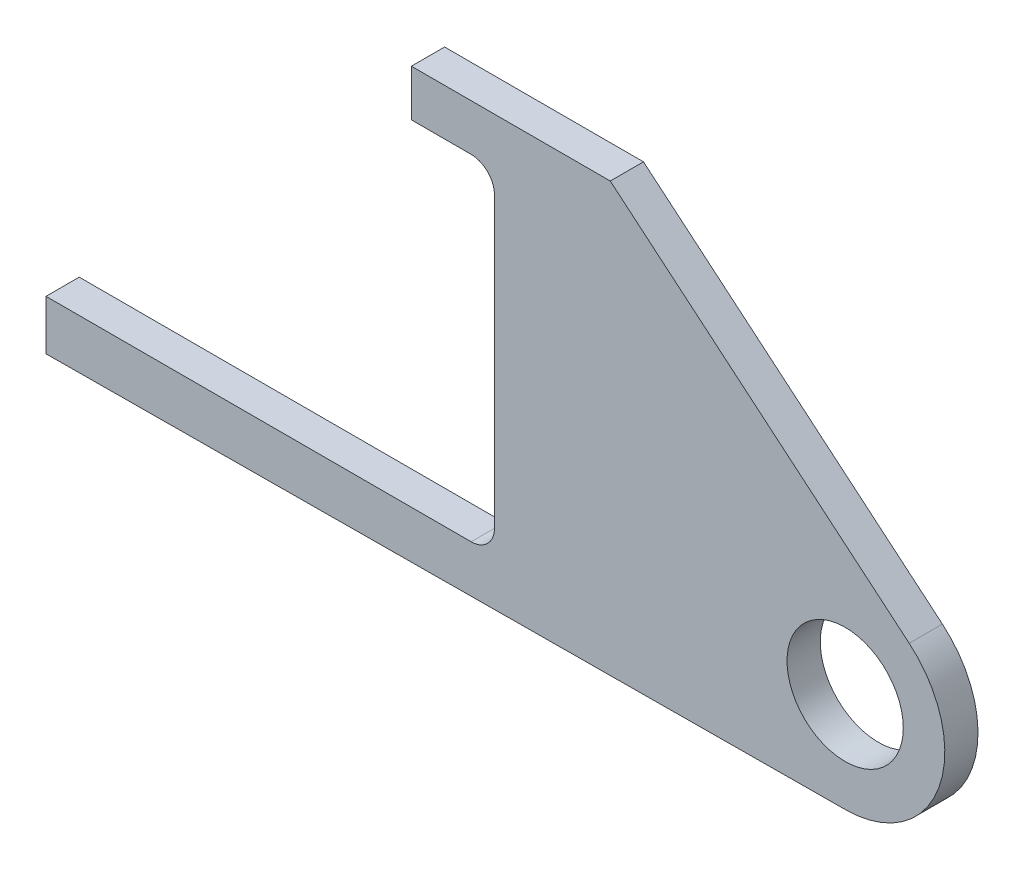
ISO-10303-21;
HEADER;
FILE_DESCRIPTION(('STEP AP214'),'2;1');
FILE_NAME('part.step','',(''),(''),'','','');
FILE_SCHEMA(('AUTOMOTIVE_DESIGN { 1 0 10303 214 1 1 1 1 }'));
ENDSEC;
DATA;
#1=APPLICATION_CONTEXT('core data for automotive mechanical design processes');
#2=APPLICATION_PROTOCOL_DEFINITION('international standard','automotive_design',2000,#1);
#3=PRODUCT_CONTEXT('',#1,'mechanical');
#4=PRODUCT('Part','Part','',(#3));
#5=PRODUCT_RELATED_PRODUCT_CATEGORY('part','',(#4));
#6=PRODUCT_DEFINITION_FORMATION('','',#4);
#7=PRODUCT_DEFINITION_CONTEXT('part definition',#1,'design');
#8=PRODUCT_DEFINITION('design','',#6,#7);
#9=PRODUCT_DEFINITION_SHAPE('','',#8);
#10=(LENGTH_UNIT() NAMED_UNIT(*) SI_UNIT(.MILLI.,.METRE.));
#11=(NAMED_UNIT(*) PLANE_ANGLE_UNIT() SI_UNIT($,.RADIAN.));
#12=(NAMED_UNIT(*) SI_UNIT($,.STERADIAN.) SOLID_ANGLE_UNIT());
#13=UNCERTAINTY_MEASURE_WITH_UNIT(LENGTH_MEASURE(1.E-05),#10,'distance_accuracy_value','');
#14=(GEOMETRIC_REPRESENTATION_CONTEXT(3) GLOBAL_UNCERTAINTY_ASSIGNED_CONTEXT((#13)) GLOBAL_UNIT_ASSIGNED_CONTEXT((#10,
#11,#12)) REPRESENTATION_CONTEXT('',''));
#15=CARTESIAN_POINT('',(0.,0.,0.));
#16=DIRECTION('',(0.,0.,1.));
#17=DIRECTION('',(1.,0.,0.));
#18=AXIS2_PLACEMENT_3D('',#15,#16,#17);
#19=CARTESIAN_POINT('',(0.,0.,20.));
#20=DIRECTION('',(0.,0.,-1.));
#21=DIRECTION('',(-1.,0.,0.));
#22=AXIS2_PLACEMENT_3D('',#19,#20,#21);
#23=PLANE('',#22);
#24=DIRECTION('',(0.,-1.,0.));
#25=VECTOR('',#24,1.);
#26=CARTESIAN_POINT('',(-481.18,-33.,20.));
#27=LINE('',#26,#25);
#28=CARTESIAN_POINT('',(-481.18,-33.,20.));
#29=VERTEX_POINT('',#28);
#30=CARTESIAN_POINT('',(-481.18,-63.,20.));
#31=VERTEX_POINT('',#30);
#32=EDGE_CURVE('E166',#29,#31,#27,.T.);
#33=ORIENTED_EDGE('',*,*,#32,.T.);
#34=DIRECTION('',(0.99998058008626,0.00623213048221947,0.));
#35=VECTOR('',#34,1.);
#36=CARTESIAN_POINT('',(0.373927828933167,-59.9988348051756,20.));
#37=LINE('',#36,#35);
#38=CARTESIAN_POINT('',(0.373927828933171,-59.9988348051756,20.));
#39=VERTEX_POINT('',#38);
#40=EDGE_CURVE('E99',#31,#39,#37,.T.);
#41=ORIENTED_EDGE('',*,*,#40,.T.);
#42=CARTESIAN_POINT('',(0.,0.,20.));
#43=DIRECTION('',(0.,0.,1.));
#44=DIRECTION('',(-1.,0.,0.));
#45=AXIS2_PLACEMENT_3D('',#42,#43,#44);
#46=CIRCLE('',#45,60.);
#47=CARTESIAN_POINT('',(38.5672565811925,45.9626665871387,20.));
#48=VERTEX_POINT('',#47);
#49=EDGE_CURVE('E190',#39,#48,#46,.T.);
#50=ORIENTED_EDGE('',*,*,#49,.T.);
#51=DIRECTION('',(-0.766044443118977,0.64278760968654,0.));
#52=VECTOR('',#51,1.);
#53=CARTESIAN_POINT('',(-141.432028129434,197.,20.));
#54=LINE('',#53,#52);
#55=CARTESIAN_POINT('',(-141.432028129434,197.,20.));
#56=VERTEX_POINT('',#55);
#57=EDGE_CURVE('E209',#48,#56,#54,.T.);
#58=ORIENTED_EDGE('',*,*,#57,.T.);
#59=DIRECTION('',(-1.,0.,0.));
#60=VECTOR('',#59,1.);
#61=CARTESIAN_POINT('',(-261.18,197.,20.));
#62=LINE('',#61,#60);
#63=CARTESIAN_POINT('',(-261.18,197.,20.));
#64=VERTEX_POINT('',#63);
#65=EDGE_CURVE('E206',#56,#64,#62,.T.);
#66=ORIENTED_EDGE('',*,*,#65,.T.);
#67=DIRECTION('',(0.,-1.,0.));
#68=VECTOR('',#67,1.);
#69=CARTESIAN_POINT('',(-261.18,169.,20.));
#70=LINE('',#69,#68);
#71=CARTESIAN_POINT('',(-261.18,169.,20.));
#72=VERTEX_POINT('',#71);
#73=EDGE_CURVE('E208',#64,#72,#70,.T.);
#74=ORIENTED_EDGE('',*,*,#73,.T.);
#75=DIRECTION('',(1.,0.,0.));
#76=VECTOR('',#75,1.);
#77=CARTESIAN_POINT('',(-225.18,169.,20.));
#78=LINE('',#77,#76);
#79=CARTESIAN_POINT('',(-225.18,169.,20.));
#80=VERTEX_POINT('',#79);
#81=EDGE_CURVE('E211',#72,#80,#78,.T.);
#82=ORIENTED_EDGE('',*,*,#81,.T.);
#83=CARTESIAN_POINT('',(-225.18,155.,20.));
#84=DIRECTION('',(0.,0.,-1.));
#85=DIRECTION('',(1.,0.,0.));
#86=AXIS2_PLACEMENT_3D('',#83,#84,#85);
#87=CIRCLE('',#86,14.);
#88=CARTESIAN_POINT('',(-211.18,155.,20.));
#89=VERTEX_POINT('',#88);
#90=EDGE_CURVE('E127',#80,#89,#87,.T.);
#91=ORIENTED_EDGE('',*,*,#90,.T.);
#92=DIRECTION('',(0.,-1.,0.));
#93=VECTOR('',#92,1.);
#94=CARTESIAN_POINT('',(-211.18,-19.,20.));
#95=LINE('',#94,#93);
#96=CARTESIAN_POINT('',(-211.18,-19.,20.));
#97=VERTEX_POINT('',#96);
#98=EDGE_CURVE('E121',#89,#97,#95,.T.);
#99=ORIENTED_EDGE('',*,*,#98,.T.);
#100=CARTESIAN_POINT('',(-225.18,-19.,20.));
#101=DIRECTION('',(0.,0.,-1.));
#102=DIRECTION('',(1.,0.,0.));
#103=AXIS2_PLACEMENT_3D('',#100,#101,#102);
#104=CIRCLE('',#103,14.);
#105=CARTESIAN_POINT('',(-225.18,-33.,20.));
#106=VERTEX_POINT('',#105);
#107=EDGE_CURVE('E125',#97,#106,#104,.T.);
#108=ORIENTED_EDGE('',*,*,#107,.T.);
#109=DIRECTION('',(-1.,0.,0.));
#110=VECTOR('',#109,1.);
#111=CARTESIAN_POINT('',(-481.18,-33.,20.));
#112=LINE('',#111,#110);
#113=EDGE_CURVE('E47',#106,#29,#112,.T.);
#114=ORIENTED_EDGE('',*,*,#113,.T.);
#115=EDGE_LOOP('',(#33,#41,#50,#58,#66,#74,#82,#91,#99,#108,#114));
#116=FACE_BOUND('',#115,.T.);
#117=CARTESIAN_POINT('',(0.,0.,20.));
#118=DIRECTION('',(0.,0.,1.));
#119=DIRECTION('',(1.,0.,0.));
#120=AXIS2_PLACEMENT_3D('',#117,#118,#119);
#121=CIRCLE('',#120,35.);
#122=CARTESIAN_POINT('',(35.,0.,20.));
#123=VERTEX_POINT('',#122);
#124=EDGE_CURVE('E149',#123,#123,#121,.T.);
#125=ORIENTED_EDGE('',*,*,#124,.F.);
#126=EDGE_LOOP('',(#125));
#127=FACE_BOUND('',#126,.T.);
#128=ADVANCED_FACE('F30',(#116,#127),#23,.F.);
#129=CARTESIAN_POINT('',(0.,0.,0.));
#130=DIRECTION('',(0.,0.,-1.));
#131=DIRECTION('',(-1.,0.,0.));
#132=AXIS2_PLACEMENT_3D('',#129,#130,#131);
#133=PLANE('',#132);
#134=DIRECTION('',(0.,-1.,0.));
#135=VECTOR('',#134,1.);
#136=CARTESIAN_POINT('',(-481.18,-33.,0.));
#137=LINE('',#136,#135);
#138=CARTESIAN_POINT('',(-481.18,-33.,0.));
#139=VERTEX_POINT('',#138);
#140=CARTESIAN_POINT('',(-481.18,-63.,0.));
#141=VERTEX_POINT('',#140);
#142=EDGE_CURVE('E145',#139,#141,#137,.T.);
#143=ORIENTED_EDGE('',*,*,#142,.F.);
#144=DIRECTION('',(-1.,0.,0.));
#145=VECTOR('',#144,1.);
#146=CARTESIAN_POINT('',(-481.18,-33.,0.));
#147=LINE('',#146,#145);
#148=CARTESIAN_POINT('',(-225.18,-33.,0.));
#149=VERTEX_POINT('',#148);
#150=EDGE_CURVE('E91',#149,#139,#147,.T.);
#151=ORIENTED_EDGE('',*,*,#150,.F.);
#152=CARTESIAN_POINT('',(-225.18,-19.,0.));
#153=DIRECTION('',(0.,0.,-1.));
#154=DIRECTION('',(1.,0.,0.));
#155=AXIS2_PLACEMENT_3D('',#152,#153,#154);
#156=CIRCLE('',#155,14.);
#157=CARTESIAN_POINT('',(-211.18,-19.,0.));
#158=VERTEX_POINT('',#157);
#159=EDGE_CURVE('E85',#158,#149,#156,.T.);
#160=ORIENTED_EDGE('',*,*,#159,.F.);
#161=DIRECTION('',(0.,-1.,0.));
#162=VECTOR('',#161,1.);
#163=CARTESIAN_POINT('',(-211.18,-19.,0.));
#164=LINE('',#163,#162);
#165=CARTESIAN_POINT('',(-211.18,155.,0.));
#166=VERTEX_POINT('',#165);
#167=EDGE_CURVE('E135',#166,#158,#164,.T.);
#168=ORIENTED_EDGE('',*,*,#167,.F.);
#169=CARTESIAN_POINT('',(-225.18,155.,0.));
#170=DIRECTION('',(0.,0.,-1.));
#171=DIRECTION('',(1.,0.,0.));
#172=AXIS2_PLACEMENT_3D('',#169,#170,#171);
#173=CIRCLE('',#172,14.);
#174=CARTESIAN_POINT('',(-225.18,169.,0.));
#175=VERTEX_POINT('',#174);
#176=EDGE_CURVE('E161',#175,#166,#173,.T.);
#177=ORIENTED_EDGE('',*,*,#176,.F.);
#178=DIRECTION('',(1.,0.,0.));
#179=VECTOR('',#178,1.);
#180=CARTESIAN_POINT('',(-225.18,169.,0.));
#181=LINE('',#180,#179);
#182=CARTESIAN_POINT('',(-261.18,169.,0.));
#183=VERTEX_POINT('',#182);
#184=EDGE_CURVE('E159',#183,#175,#181,.T.);
#185=ORIENTED_EDGE('',*,*,#184,.F.);
#186=DIRECTION('',(0.,-1.,0.));
#187=VECTOR('',#186,1.);
#188=CARTESIAN_POINT('',(-261.18,169.,0.));
#189=LINE('',#188,#187);
#190=CARTESIAN_POINT('',(-261.18,197.,0.));
#191=VERTEX_POINT('',#190);
#192=EDGE_CURVE('E157',#191,#183,#189,.T.);
#193=ORIENTED_EDGE('',*,*,#192,.F.);
#194=DIRECTION('',(-1.,0.,0.));
#195=VECTOR('',#194,1.);
#196=CARTESIAN_POINT('',(-261.18,197.,0.));
#197=LINE('',#196,#195);
#198=CARTESIAN_POINT('',(-141.432028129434,197.,0.));
#199=VERTEX_POINT('',#198);
#200=EDGE_CURVE('E155',#199,#191,#197,.T.);
#201=ORIENTED_EDGE('',*,*,#200,.F.);
#202=DIRECTION('',(-0.766044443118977,0.64278760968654,0.));
#203=VECTOR('',#202,1.);
#204=CARTESIAN_POINT('',(-141.432028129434,197.,0.));
#205=LINE('',#204,#203);
#206=CARTESIAN_POINT('',(38.5672565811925,45.9626665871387,0.));
#207=VERTEX_POINT('',#206);
#208=EDGE_CURVE('E153',#207,#199,#205,.T.);
#209=ORIENTED_EDGE('',*,*,#208,.F.);
#210=CARTESIAN_POINT('',(0.,0.,0.));
#211=DIRECTION('',(0.,0.,1.));
#212=DIRECTION('',(-1.,0.,0.));
#213=AXIS2_PLACEMENT_3D('',#210,#211,#212);
#214=CIRCLE('',#213,60.);
#215=CARTESIAN_POINT('',(0.373927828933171,-59.9988348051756,0.));
#216=VERTEX_POINT('',#215);
#217=EDGE_CURVE('E151',#216,#207,#214,.T.);
#218=ORIENTED_EDGE('',*,*,#217,.F.);
#219=DIRECTION('',(0.99998058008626,0.00623213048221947,0.));
#220=VECTOR('',#219,1.);
#221=CARTESIAN_POINT('',(0.373927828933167,-59.9988348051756,0.));
#222=LINE('',#221,#220);
#223=EDGE_CURVE('E148',#141,#216,#222,.T.);
#224=ORIENTED_EDGE('',*,*,#223,.F.);
#225=EDGE_LOOP('',(#143,#151,#160,#168,#177,#185,#193,#201,#209,#218,#224));
#226=FACE_BOUND('',#225,.T.);
#227=CARTESIAN_POINT('',(0.,0.,0.));
#228=DIRECTION('',(0.,0.,1.));
#229=DIRECTION('',(1.,0.,0.));
#230=AXIS2_PLACEMENT_3D('',#227,#228,#229);
#231=CIRCLE('',#230,35.);
#232=CARTESIAN_POINT('',(35.,0.,0.));
#233=VERTEX_POINT('',#232);
#234=EDGE_CURVE('E349',#233,#233,#231,.T.);
#235=ORIENTED_EDGE('',*,*,#234,.T.);
#236=EDGE_LOOP('',(#235));
#237=FACE_BOUND('',#236,.T.);
#238=ADVANCED_FACE('F194',(#226,#237),#133,.T.);
#239=CARTESIAN_POINT('',(-481.18,-33.,20.));
#240=DIRECTION('',(1.,0.,0.));
#241=DIRECTION('',(0.,0.,-1.));
#242=AXIS2_PLACEMENT_3D('',#239,#240,#241);
#243=PLANE('',#242);
#244=ORIENTED_EDGE('',*,*,#142,.T.);
#245=DIRECTION('',(0.,0.,-1.));
#246=VECTOR('',#245,1.);
#247=CARTESIAN_POINT('',(-481.18,-63.,20.));
#248=LINE('',#247,#246);
#249=EDGE_CURVE('E11',#31,#141,#248,.T.);
#250=ORIENTED_EDGE('',*,*,#249,.F.);
#251=ORIENTED_EDGE('',*,*,#32,.F.);
#252=DIRECTION('',(0.,0.,-1.));
#253=VECTOR('',#252,1.);
#254=CARTESIAN_POINT('',(-481.18,-33.,20.));
#255=LINE('',#254,#253);
#256=EDGE_CURVE('E141',#29,#139,#255,.T.);
#257=ORIENTED_EDGE('',*,*,#256,.T.);
#258=EDGE_LOOP('',(#244,#250,#251,#257));
#259=FACE_BOUND('',#258,.T.);
#260=ADVANCED_FACE('F32',(#259),#243,.F.);
#261=CARTESIAN_POINT('',(0.373927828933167,-59.9988348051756,20.));
#262=DIRECTION('',(-0.00623213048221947,0.99998058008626,0.));
#263=DIRECTION('',(-0.99998058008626,-0.00623213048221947,0.));
#264=AXIS2_PLACEMENT_3D('',#261,#262,#263);
#265=PLANE('',#264);
#266=ORIENTED_EDGE('',*,*,#223,.T.);
#267=DIRECTION('',(0.,0.,-1.));
#268=VECTOR('',#267,1.);
#269=CARTESIAN_POINT('',(0.373927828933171,-59.9988348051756,20.));
#270=LINE('',#269,#268);
#271=EDGE_CURVE('E39',#39,#216,#270,.T.);
#272=ORIENTED_EDGE('',*,*,#271,.F.);
#273=ORIENTED_EDGE('',*,*,#40,.F.);
#274=ORIENTED_EDGE('',*,*,#249,.T.);
#275=EDGE_LOOP('',(#266,#272,#273,#274));
#276=FACE_BOUND('',#275,.T.);
#277=ADVANCED_FACE('F248',(#276),#265,.F.);
#278=CARTESIAN_POINT('',(0.,0.,20.));
#279=DIRECTION('',(0.,0.,-1.));
#280=DIRECTION('',(-1.,0.,0.));
#281=AXIS2_PLACEMENT_3D('',#278,#279,#280);
#282=CYLINDRICAL_SURFACE('',#281,60.);
#283=ORIENTED_EDGE('',*,*,#217,.T.);
#284=DIRECTION('',(0.,0.,-1.));
#285=VECTOR('',#284,1.);
#286=CARTESIAN_POINT('',(38.5672565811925,45.9626665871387,20.));
#287=LINE('',#286,#285);
#288=EDGE_CURVE('E182',#48,#207,#287,.T.);
#289=ORIENTED_EDGE('',*,*,#288,.F.);
#290=ORIENTED_EDGE('',*,*,#49,.F.);
#291=ORIENTED_EDGE('',*,*,#271,.T.);
#292=EDGE_LOOP('',(#283,#289,#290,#291));
#293=FACE_BOUND('',#292,.T.);
#294=ADVANCED_FACE('F188',(#293),#282,.T.);
#295=CARTESIAN_POINT('',(-141.432028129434,197.,20.));
#296=DIRECTION('',(-0.64278760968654,-0.766044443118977,0.));
#297=DIRECTION('',(0.766044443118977,-0.64278760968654,0.));
#298=AXIS2_PLACEMENT_3D('',#295,#296,#297);
#299=PLANE('',#298);
#300=ORIENTED_EDGE('',*,*,#208,.T.);
#301=DIRECTION('',(0.,0.,-1.));
#302=VECTOR('',#301,1.);
#303=CARTESIAN_POINT('',(-141.432028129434,197.,20.));
#304=LINE('',#303,#302);
#305=EDGE_CURVE('E179',#56,#199,#304,.T.);
#306=ORIENTED_EDGE('',*,*,#305,.F.);
#307=ORIENTED_EDGE('',*,*,#57,.F.);
#308=ORIENTED_EDGE('',*,*,#288,.T.);
#309=EDGE_LOOP('',(#300,#306,#307,#308));
#310=FACE_BOUND('',#309,.T.);
#311=ADVANCED_FACE('F200',(#310),#299,.F.);
#312=CARTESIAN_POINT('',(-261.18,197.,20.));
#313=DIRECTION('',(0.,-1.,0.));
#314=DIRECTION('',(1.,0.,0.));
#315=AXIS2_PLACEMENT_3D('',#312,#313,#314);
#316=PLANE('',#315);
#317=ORIENTED_EDGE('',*,*,#200,.T.);
#318=DIRECTION('',(0.,0.,-1.));
#319=VECTOR('',#318,1.);
#320=CARTESIAN_POINT('',(-261.18,197.,20.));
#321=LINE('',#320,#319);
#322=EDGE_CURVE('E176',#64,#191,#321,.T.);
#323=ORIENTED_EDGE('',*,*,#322,.F.);
#324=ORIENTED_EDGE('',*,*,#65,.F.);
#325=ORIENTED_EDGE('',*,*,#305,.T.);
#326=EDGE_LOOP('',(#317,#323,#324,#325));
#327=FACE_BOUND('',#326,.T.);
#328=ADVANCED_FACE('F204',(#327),#316,.F.);
#329=CARTESIAN_POINT('',(-261.18,169.,20.));
#330=DIRECTION('',(1.,0.,0.));
#331=DIRECTION('',(0.,0.,-1.));
#332=AXIS2_PLACEMENT_3D('',#329,#330,#331);
#333=PLANE('',#332);
#334=ORIENTED_EDGE('',*,*,#192,.T.);
#335=DIRECTION('',(0.,0.,-1.));
#336=VECTOR('',#335,1.);
#337=CARTESIAN_POINT('',(-261.18,169.,20.));
#338=LINE('',#337,#336);
#339=EDGE_CURVE('E173',#72,#183,#338,.T.);
#340=ORIENTED_EDGE('',*,*,#339,.F.);
#341=ORIENTED_EDGE('',*,*,#73,.F.);
#342=ORIENTED_EDGE('',*,*,#322,.T.);
#343=EDGE_LOOP('',(#334,#340,#341,#342));
#344=FACE_BOUND('',#343,.T.);
#345=ADVANCED_FACE('F261',(#344),#333,.F.);
#346=CARTESIAN_POINT('',(-225.18,169.,20.));
#347=DIRECTION('',(0.,1.,0.));
#348=DIRECTION('',(0.,0.,1.));
#349=AXIS2_PLACEMENT_3D('',#346,#347,#348);
#350=PLANE('',#349);
#351=ORIENTED_EDGE('',*,*,#184,.T.);
#352=DIRECTION('',(0.,0.,-1.));
#353=VECTOR('',#352,1.);
#354=CARTESIAN_POINT('',(-225.18,169.,20.));
#355=LINE('',#354,#353);
#356=EDGE_CURVE('E170',#80,#175,#355,.T.);
#357=ORIENTED_EDGE('',*,*,#356,.F.);
#358=ORIENTED_EDGE('',*,*,#81,.F.);
#359=ORIENTED_EDGE('',*,*,#339,.T.);
#360=EDGE_LOOP('',(#351,#357,#358,#359));
#361=FACE_BOUND('',#360,.T.);
#362=ADVANCED_FACE('F220',(#361),#350,.F.);
#363=CARTESIAN_POINT('',(-225.18,155.,20.));
#364=DIRECTION('',(0.,0.,-1.));
#365=DIRECTION('',(-1.,0.,0.));
#366=AXIS2_PLACEMENT_3D('',#363,#364,#365);
#367=CYLINDRICAL_SURFACE('',#366,14.);
#368=ORIENTED_EDGE('',*,*,#176,.T.);
#369=DIRECTION('',(0.,0.,-1.));
#370=VECTOR('',#369,1.);
#371=CARTESIAN_POINT('',(-211.18,155.,20.));
#372=LINE('',#371,#370);
#373=EDGE_CURVE('E136',#89,#166,#372,.T.);
#374=ORIENTED_EDGE('',*,*,#373,.F.);
#375=ORIENTED_EDGE('',*,*,#90,.F.);
#376=ORIENTED_EDGE('',*,*,#356,.T.);
#377=EDGE_LOOP('',(#368,#374,#375,#376));
#378=FACE_BOUND('',#377,.T.);
#379=ADVANCED_FACE('F224',(#378),#367,.F.);
#380=CARTESIAN_POINT('',(-211.18,-19.,20.));
#381=DIRECTION('',(1.,0.,0.));
#382=DIRECTION('',(0.,0.,-1.));
#383=AXIS2_PLACEMENT_3D('',#380,#381,#382);
#384=PLANE('',#383);
#385=ORIENTED_EDGE('',*,*,#167,.T.);
#386=DIRECTION('',(0.,0.,-1.));
#387=VECTOR('',#386,1.);
#388=CARTESIAN_POINT('',(-211.18,-19.,20.));
#389=LINE('',#388,#387);
#390=EDGE_CURVE('E132',#97,#158,#389,.T.);
#391=ORIENTED_EDGE('',*,*,#390,.F.);
#392=ORIENTED_EDGE('',*,*,#98,.F.);
#393=ORIENTED_EDGE('',*,*,#373,.T.);
#394=EDGE_LOOP('',(#385,#391,#392,#393));
#395=FACE_BOUND('',#394,.T.);
#396=ADVANCED_FACE('F133',(#395),#384,.F.);
#397=CARTESIAN_POINT('',(-225.18,-19.,20.));
#398=DIRECTION('',(0.,0.,-1.));
#399=DIRECTION('',(-1.,0.,0.));
#400=AXIS2_PLACEMENT_3D('',#397,#398,#399);
#401=CYLINDRICAL_SURFACE('',#400,14.);
#402=ORIENTED_EDGE('',*,*,#159,.T.);
#403=DIRECTION('',(0.,0.,-1.));
#404=VECTOR('',#403,1.);
#405=CARTESIAN_POINT('',(-225.18,-33.,20.));
#406=LINE('',#405,#404);
#407=EDGE_CURVE('E137',#106,#149,#406,.T.);
#408=ORIENTED_EDGE('',*,*,#407,.F.);
#409=ORIENTED_EDGE('',*,*,#107,.F.);
#410=ORIENTED_EDGE('',*,*,#390,.T.);
#411=EDGE_LOOP('',(#402,#408,#409,#410));
#412=FACE_BOUND('',#411,.T.);
#413=ADVANCED_FACE('F139',(#412),#401,.F.);
#414=CARTESIAN_POINT('',(-481.18,-33.,20.));
#415=DIRECTION('',(0.,-1.,0.));
#416=DIRECTION('',(1.,0.,0.));
#417=AXIS2_PLACEMENT_3D('',#414,#415,#416);
#418=PLANE('',#417);
#419=ORIENTED_EDGE('',*,*,#150,.T.);
#420=ORIENTED_EDGE('',*,*,#256,.F.);
#421=ORIENTED_EDGE('',*,*,#113,.F.);
#422=ORIENTED_EDGE('',*,*,#407,.T.);
#423=EDGE_LOOP('',(#419,#420,#421,#422));
#424=FACE_BOUND('',#423,.T.);
#425=ADVANCED_FACE('F228',(#424),#418,.F.);
#426=CARTESIAN_POINT('',(0.,0.,20.));
#427=DIRECTION('',(0.,0.,-1.));
#428=DIRECTION('',(-1.,0.,0.));
#429=AXIS2_PLACEMENT_3D('',#426,#427,#428);
#430=CYLINDRICAL_SURFACE('',#429,35.);
#431=ORIENTED_EDGE('',*,*,#124,.T.);
#432=EDGE_LOOP('',(#431));
#433=FACE_BOUND('',#432,.T.);
#434=ORIENTED_EDGE('',*,*,#234,.F.);
#435=EDGE_LOOP('',(#434));
#436=FACE_BOUND('',#435,.T.);
#437=ADVANCED_FACE('F230',(#433,#436),#430,.F.);
#438=CLOSED_SHELL('',(#128,#238,#260,#277,#294,#311,#328,#345,#362,#379,#396,#413,#425,#437));
#439=MANIFOLD_SOLID_BREP('B2',#438);
#440=ADVANCED_BREP_SHAPE_REPRESENTATION('',(#18,#439),#14);
#441=SHAPE_DEFINITION_REPRESENTATION(#9,#440);
ENDSEC;
END-ISO-10303-21;
